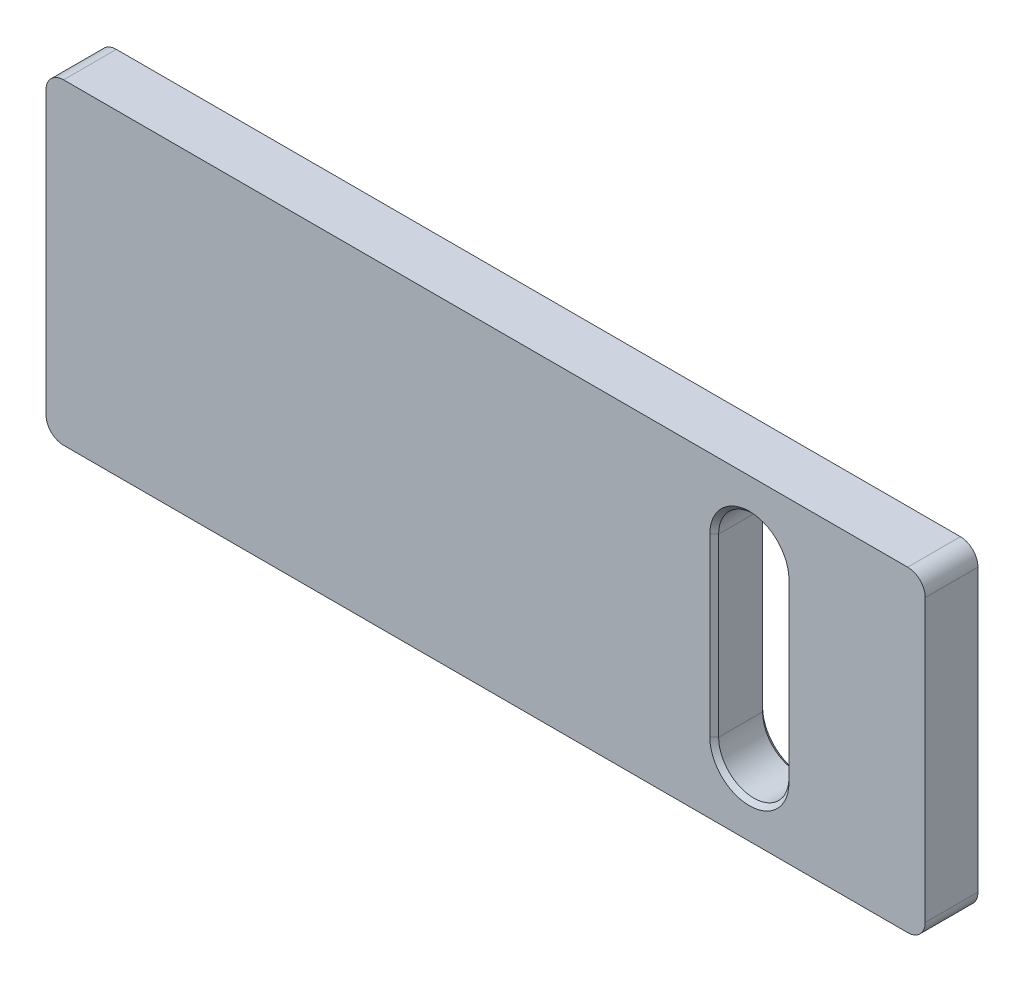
ISO-10303-21;
HEADER;
FILE_DESCRIPTION(('STEP AP214'),'2;1');
FILE_NAME('part.step','',(''),(''),'','','');
FILE_SCHEMA(('AUTOMOTIVE_DESIGN { 1 0 10303 214 1 1 1 1 }'));
ENDSEC;
DATA;
#1=APPLICATION_CONTEXT('core data for automotive mechanical design processes');
#2=APPLICATION_PROTOCOL_DEFINITION('international standard','automotive_design',2000,#1);
#3=PRODUCT_CONTEXT('',#1,'mechanical');
#4=PRODUCT('Part','Part','',(#3));
#5=PRODUCT_RELATED_PRODUCT_CATEGORY('part','',(#4));
#6=PRODUCT_DEFINITION_FORMATION('','',#4);
#7=PRODUCT_DEFINITION_CONTEXT('part definition',#1,'design');
#8=PRODUCT_DEFINITION('design','',#6,#7);
#9=PRODUCT_DEFINITION_SHAPE('','',#8);
#10=(LENGTH_UNIT() NAMED_UNIT(*) SI_UNIT(.MILLI.,.METRE.));
#11=(NAMED_UNIT(*) PLANE_ANGLE_UNIT() SI_UNIT($,.RADIAN.));
#12=(NAMED_UNIT(*) SI_UNIT($,.STERADIAN.) SOLID_ANGLE_UNIT());
#13=UNCERTAINTY_MEASURE_WITH_UNIT(LENGTH_MEASURE(1.E-05),#10,'distance_accuracy_value','');
#14=(GEOMETRIC_REPRESENTATION_CONTEXT(3) GLOBAL_UNCERTAINTY_ASSIGNED_CONTEXT((#13)) GLOBAL_UNIT_ASSIGNED_CONTEXT((#10,
#11,#12)) REPRESENTATION_CONTEXT('',''));
#15=CARTESIAN_POINT('',(0.,0.,0.));
#16=DIRECTION('',(0.,0.,1.));
#17=DIRECTION('',(1.,0.,0.));
#18=AXIS2_PLACEMENT_3D('',#15,#16,#17);
#19=CARTESIAN_POINT('',(25.,9.,3.));
#20=DIRECTION('',(-1.,0.,0.));
#21=DIRECTION('',(0.,0.,1.));
#22=AXIS2_PLACEMENT_3D('',#19,#20,#21);
#23=PLANE('',#22);
#24=DIRECTION('',(0.,1.,0.));
#25=VECTOR('',#24,1.);
#26=CARTESIAN_POINT('',(25.,9.,3.));
#27=LINE('',#26,#25);
#28=CARTESIAN_POINT('',(25.,-8.,3.));
#29=VERTEX_POINT('',#28);
#30=CARTESIAN_POINT('',(25.,8.,3.));
#31=VERTEX_POINT('',#30);
#32=EDGE_CURVE('E164',#29,#31,#27,.T.);
#33=ORIENTED_EDGE('',*,*,#32,.F.);
#34=DIRECTION('',(0.,0.,-1.));
#35=VECTOR('',#34,1.);
#36=CARTESIAN_POINT('',(25.,-8.,3.));
#37=LINE('',#36,#35);
#38=CARTESIAN_POINT('',(25.,-8.,0.));
#39=VERTEX_POINT('',#38);
#40=EDGE_CURVE('E149',#29,#39,#37,.T.);
#41=ORIENTED_EDGE('',*,*,#40,.T.);
#42=DIRECTION('',(0.,1.,0.));
#43=VECTOR('',#42,1.);
#44=CARTESIAN_POINT('',(25.,9.,0.));
#45=LINE('',#44,#43);
#46=CARTESIAN_POINT('',(25.,8.,0.));
#47=VERTEX_POINT('',#46);
#48=EDGE_CURVE('E161',#39,#47,#45,.T.);
#49=ORIENTED_EDGE('',*,*,#48,.T.);
#50=DIRECTION('',(0.,0.,-1.));
#51=VECTOR('',#50,1.);
#52=CARTESIAN_POINT('',(25.,8.,3.));
#53=LINE('',#52,#51);
#54=EDGE_CURVE('E166',#47,#31,#53,.F.);
#55=ORIENTED_EDGE('',*,*,#54,.T.);
#56=EDGE_LOOP('',(#33,#41,#49,#55));
#57=FACE_BOUND('',#56,.T.);
#58=ADVANCED_FACE('F32',(#57),#23,.F.);
#59=CARTESIAN_POINT('',(-25.,9.,3.));
#60=DIRECTION('',(0.,-1.,0.));
#61=DIRECTION('',(0.,0.,-1.));
#62=AXIS2_PLACEMENT_3D('',#59,#60,#61);
#63=PLANE('',#62);
#64=DIRECTION('',(-1.,0.,0.));
#65=VECTOR('',#64,1.);
#66=CARTESIAN_POINT('',(-25.,9.,3.));
#67=LINE('',#66,#65);
#68=CARTESIAN_POINT('',(24.,9.,3.));
#69=VERTEX_POINT('',#68);
#70=CARTESIAN_POINT('',(-24.,9.,3.));
#71=VERTEX_POINT('',#70);
#72=EDGE_CURVE('E288',#69,#71,#67,.T.);
#73=ORIENTED_EDGE('',*,*,#72,.F.);
#74=DIRECTION('',(0.,0.,-1.));
#75=VECTOR('',#74,1.);
#76=CARTESIAN_POINT('',(24.,9.,3.));
#77=LINE('',#76,#75);
#78=CARTESIAN_POINT('',(24.,9.,0.));
#79=VERTEX_POINT('',#78);
#80=EDGE_CURVE('E210',#69,#79,#77,.T.);
#81=ORIENTED_EDGE('',*,*,#80,.T.);
#82=DIRECTION('',(-1.,0.,0.));
#83=VECTOR('',#82,1.);
#84=CARTESIAN_POINT('',(-25.,9.,0.));
#85=LINE('',#84,#83);
#86=CARTESIAN_POINT('',(-24.,9.,0.));
#87=VERTEX_POINT('',#86);
#88=EDGE_CURVE('E171',#79,#87,#85,.T.);
#89=ORIENTED_EDGE('',*,*,#88,.T.);
#90=DIRECTION('',(0.,0.,-1.));
#91=VECTOR('',#90,1.);
#92=CARTESIAN_POINT('',(-24.,9.,3.));
#93=LINE('',#92,#91);
#94=EDGE_CURVE('E208',#87,#71,#93,.F.);
#95=ORIENTED_EDGE('',*,*,#94,.T.);
#96=EDGE_LOOP('',(#73,#81,#89,#95));
#97=FACE_BOUND('',#96,.T.);
#98=ADVANCED_FACE('F341',(#97),#63,.F.);
#99=CARTESIAN_POINT('',(-25.,9.,3.));
#100=DIRECTION('',(1.,0.,0.));
#101=DIRECTION('',(0.,0.,-1.));
#102=AXIS2_PLACEMENT_3D('',#99,#100,#101);
#103=PLANE('',#102);
#104=DIRECTION('',(0.,-1.,0.));
#105=VECTOR('',#104,1.);
#106=CARTESIAN_POINT('',(-25.,9.,0.));
#107=LINE('',#106,#105);
#108=CARTESIAN_POINT('',(-25.,8.,0.));
#109=VERTEX_POINT('',#108);
#110=CARTESIAN_POINT('',(-25.,-8.,0.));
#111=VERTEX_POINT('',#110);
#112=EDGE_CURVE('E175',#109,#111,#107,.T.);
#113=ORIENTED_EDGE('',*,*,#112,.T.);
#114=DIRECTION('',(0.,0.,-1.));
#115=VECTOR('',#114,1.);
#116=CARTESIAN_POINT('',(-25.,-8.,3.));
#117=LINE('',#116,#115);
#118=CARTESIAN_POINT('',(-25.,-8.,3.));
#119=VERTEX_POINT('',#118);
#120=EDGE_CURVE('E206',#111,#119,#117,.F.);
#121=ORIENTED_EDGE('',*,*,#120,.T.);
#122=DIRECTION('',(0.,-1.,0.));
#123=VECTOR('',#122,1.);
#124=CARTESIAN_POINT('',(-25.,9.,3.));
#125=LINE('',#124,#123);
#126=CARTESIAN_POINT('',(-25.,8.,3.));
#127=VERTEX_POINT('',#126);
#128=EDGE_CURVE('E287',#127,#119,#125,.T.);
#129=ORIENTED_EDGE('',*,*,#128,.F.);
#130=DIRECTION('',(0.,0.,-1.));
#131=VECTOR('',#130,1.);
#132=CARTESIAN_POINT('',(-25.,8.,3.));
#133=LINE('',#132,#131);
#134=EDGE_CURVE('E203',#127,#109,#133,.T.);
#135=ORIENTED_EDGE('',*,*,#134,.T.);
#136=EDGE_LOOP('',(#113,#121,#129,#135));
#137=FACE_BOUND('',#136,.T.);
#138=ADVANCED_FACE('F346',(#137),#103,.F.);
#139=CARTESIAN_POINT('',(-25.,-9.,3.));
#140=DIRECTION('',(0.,1.,0.));
#141=DIRECTION('',(0.,0.,1.));
#142=AXIS2_PLACEMENT_3D('',#139,#140,#141);
#143=PLANE('',#142);
#144=DIRECTION('',(1.,0.,0.));
#145=VECTOR('',#144,1.);
#146=CARTESIAN_POINT('',(-25.,-9.,0.));
#147=LINE('',#146,#145);
#148=CARTESIAN_POINT('',(-24.,-9.,0.));
#149=VERTEX_POINT('',#148);
#150=CARTESIAN_POINT('',(24.,-9.,0.));
#151=VERTEX_POINT('',#150);
#152=EDGE_CURVE('E186',#149,#151,#147,.T.);
#153=ORIENTED_EDGE('',*,*,#152,.T.);
#154=DIRECTION('',(0.,0.,-1.));
#155=VECTOR('',#154,1.);
#156=CARTESIAN_POINT('',(24.,-9.,3.));
#157=LINE('',#156,#155);
#158=CARTESIAN_POINT('',(24.,-9.,3.));
#159=VERTEX_POINT('',#158);
#160=EDGE_CURVE('E150',#151,#159,#157,.F.);
#161=ORIENTED_EDGE('',*,*,#160,.T.);
#162=DIRECTION('',(1.,0.,0.));
#163=VECTOR('',#162,1.);
#164=CARTESIAN_POINT('',(-25.,-9.,3.));
#165=LINE('',#164,#163);
#166=CARTESIAN_POINT('',(-24.,-9.,3.));
#167=VERTEX_POINT('',#166);
#168=EDGE_CURVE('E181',#167,#159,#165,.T.);
#169=ORIENTED_EDGE('',*,*,#168,.F.);
#170=DIRECTION('',(0.,0.,-1.));
#171=VECTOR('',#170,1.);
#172=CARTESIAN_POINT('',(-24.,-9.,3.));
#173=LINE('',#172,#171);
#174=EDGE_CURVE('E155',#167,#149,#173,.T.);
#175=ORIENTED_EDGE('',*,*,#174,.T.);
#176=EDGE_LOOP('',(#153,#161,#169,#175));
#177=FACE_BOUND('',#176,.T.);
#178=ADVANCED_FACE('F279',(#177),#143,.F.);
#179=CARTESIAN_POINT('',(0.,0.,3.));
#180=DIRECTION('',(0.,0.,1.));
#181=DIRECTION('',(1.,0.,0.));
#182=AXIS2_PLACEMENT_3D('',#179,#180,#181);
#183=PLANE('',#182);
#184=DIRECTION('',(0.,1.,0.));
#185=VECTOR('',#184,1.);
#186=CARTESIAN_POINT('',(12.75,5.,3.));
#187=LINE('',#186,#185);
#188=CARTESIAN_POINT('',(12.75,-5.,3.));
#189=VERTEX_POINT('',#188);
#190=CARTESIAN_POINT('',(12.75,5.,3.));
#191=VERTEX_POINT('',#190);
#192=EDGE_CURVE('E41',#189,#191,#187,.T.);
#193=ORIENTED_EDGE('',*,*,#192,.T.);
#194=CARTESIAN_POINT('',(15.,5.,3.));
#195=DIRECTION('',(0.,0.,1.));
#196=DIRECTION('',(1.,0.,0.));
#197=AXIS2_PLACEMENT_3D('',#194,#195,#196);
#198=CIRCLE('',#197,2.25);
#199=CARTESIAN_POINT('',(17.25,5.,3.));
#200=VERTEX_POINT('',#199);
#201=EDGE_CURVE('E11',#191,#200,#198,.F.);
#202=ORIENTED_EDGE('',*,*,#201,.T.);
#203=DIRECTION('',(0.,-1.,0.));
#204=VECTOR('',#203,1.);
#205=CARTESIAN_POINT('',(17.25,-5.,3.));
#206=LINE('',#205,#204);
#207=CARTESIAN_POINT('',(17.25,-5.,3.));
#208=VERTEX_POINT('',#207);
#209=EDGE_CURVE('E240',#200,#208,#206,.T.);
#210=ORIENTED_EDGE('',*,*,#209,.T.);
#211=CARTESIAN_POINT('',(15.,-5.,3.));
#212=DIRECTION('',(0.,0.,1.));
#213=DIRECTION('',(1.,0.,0.));
#214=AXIS2_PLACEMENT_3D('',#211,#212,#213);
#215=CIRCLE('',#214,2.24999999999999);
#216=EDGE_CURVE('E52',#208,#189,#215,.F.);
#217=ORIENTED_EDGE('',*,*,#216,.T.);
#218=EDGE_LOOP('',(#193,#202,#210,#217));
#219=FACE_BOUND('',#218,.T.);
#220=ORIENTED_EDGE('',*,*,#168,.T.);
#221=CARTESIAN_POINT('',(24.,-8.,3.));
#222=DIRECTION('',(0.,0.,1.));
#223=DIRECTION('',(1.,0.,0.));
#224=AXIS2_PLACEMENT_3D('',#221,#222,#223);
#225=CIRCLE('',#224,1.);
#226=EDGE_CURVE('E201',#159,#29,#225,.T.);
#227=ORIENTED_EDGE('',*,*,#226,.T.);
#228=ORIENTED_EDGE('',*,*,#32,.T.);
#229=CARTESIAN_POINT('',(24.,8.,3.));
#230=DIRECTION('',(0.,0.,1.));
#231=DIRECTION('',(1.,0.,0.));
#232=AXIS2_PLACEMENT_3D('',#229,#230,#231);
#233=CIRCLE('',#232,1.);
#234=EDGE_CURVE('E197',#31,#69,#233,.T.);
#235=ORIENTED_EDGE('',*,*,#234,.T.);
#236=ORIENTED_EDGE('',*,*,#72,.T.);
#237=CARTESIAN_POINT('',(-24.,8.,3.));
#238=DIRECTION('',(0.,0.,1.));
#239=DIRECTION('',(1.,0.,0.));
#240=AXIS2_PLACEMENT_3D('',#237,#238,#239);
#241=CIRCLE('',#240,1.);
#242=EDGE_CURVE('E195',#71,#127,#241,.T.);
#243=ORIENTED_EDGE('',*,*,#242,.T.);
#244=ORIENTED_EDGE('',*,*,#128,.T.);
#245=CARTESIAN_POINT('',(-24.,-8.,3.));
#246=DIRECTION('',(0.,0.,1.));
#247=DIRECTION('',(1.,0.,0.));
#248=AXIS2_PLACEMENT_3D('',#245,#246,#247);
#249=CIRCLE('',#248,1.);
#250=EDGE_CURVE('E199',#119,#167,#249,.T.);
#251=ORIENTED_EDGE('',*,*,#250,.T.);
#252=EDGE_LOOP('',(#220,#227,#228,#235,#236,#243,#244,#251));
#253=FACE_BOUND('',#252,.T.);
#254=ADVANCED_FACE('F276',(#219,#253),#183,.T.);
#255=CARTESIAN_POINT('',(0.,0.,0.));
#256=DIRECTION('',(0.,0.,1.));
#257=DIRECTION('',(1.,0.,0.));
#258=AXIS2_PLACEMENT_3D('',#255,#256,#257);
#259=PLANE('',#258);
#260=CARTESIAN_POINT('',(15.,5.,0.));
#261=DIRECTION('',(0.,0.,1.));
#262=DIRECTION('',(1.,0.,0.));
#263=AXIS2_PLACEMENT_3D('',#260,#261,#262);
#264=CIRCLE('',#263,2.25000000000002);
#265=CARTESIAN_POINT('',(17.25,5.,0.));
#266=VERTEX_POINT('',#265);
#267=CARTESIAN_POINT('',(12.75,5.,0.));
#268=VERTEX_POINT('',#267);
#269=EDGE_CURVE('E218',#266,#268,#264,.T.);
#270=ORIENTED_EDGE('',*,*,#269,.T.);
#271=DIRECTION('',(0.,-1.,0.));
#272=VECTOR('',#271,1.);
#273=CARTESIAN_POINT('',(12.75,0.,0.));
#274=LINE('',#273,#272);
#275=CARTESIAN_POINT('',(12.75,-5.,0.));
#276=VERTEX_POINT('',#275);
#277=EDGE_CURVE('E224',#268,#276,#274,.T.);
#278=ORIENTED_EDGE('',*,*,#277,.T.);
#279=CARTESIAN_POINT('',(15.,-5.,0.));
#280=DIRECTION('',(0.,0.,1.));
#281=DIRECTION('',(1.,0.,0.));
#282=AXIS2_PLACEMENT_3D('',#279,#280,#281);
#283=CIRCLE('',#282,2.25000000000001);
#284=CARTESIAN_POINT('',(17.25,-5.,0.));
#285=VERTEX_POINT('',#284);
#286=EDGE_CURVE('E222',#276,#285,#283,.T.);
#287=ORIENTED_EDGE('',*,*,#286,.T.);
#288=DIRECTION('',(0.,1.,0.));
#289=VECTOR('',#288,1.);
#290=CARTESIAN_POINT('',(17.25,0.,0.));
#291=LINE('',#290,#289);
#292=EDGE_CURVE('E220',#285,#266,#291,.T.);
#293=ORIENTED_EDGE('',*,*,#292,.T.);
#294=EDGE_LOOP('',(#270,#278,#287,#293));
#295=FACE_BOUND('',#294,.T.);
#296=ORIENTED_EDGE('',*,*,#48,.F.);
#297=CARTESIAN_POINT('',(24.,-8.,0.));
#298=DIRECTION('',(0.,0.,1.));
#299=DIRECTION('',(1.,0.,0.));
#300=AXIS2_PLACEMENT_3D('',#297,#298,#299);
#301=CIRCLE('',#300,1.);
#302=EDGE_CURVE('E145',#39,#151,#301,.F.);
#303=ORIENTED_EDGE('',*,*,#302,.T.);
#304=ORIENTED_EDGE('',*,*,#152,.F.);
#305=CARTESIAN_POINT('',(-24.,-8.,0.));
#306=DIRECTION('',(0.,0.,1.));
#307=DIRECTION('',(1.,0.,0.));
#308=AXIS2_PLACEMENT_3D('',#305,#306,#307);
#309=CIRCLE('',#308,1.);
#310=EDGE_CURVE('E156',#149,#111,#309,.F.);
#311=ORIENTED_EDGE('',*,*,#310,.T.);
#312=ORIENTED_EDGE('',*,*,#112,.F.);
#313=CARTESIAN_POINT('',(-24.,8.,0.));
#314=DIRECTION('',(0.,0.,1.));
#315=DIRECTION('',(1.,0.,0.));
#316=AXIS2_PLACEMENT_3D('',#313,#314,#315);
#317=CIRCLE('',#316,1.);
#318=EDGE_CURVE('E165',#109,#87,#317,.F.);
#319=ORIENTED_EDGE('',*,*,#318,.T.);
#320=ORIENTED_EDGE('',*,*,#88,.F.);
#321=CARTESIAN_POINT('',(24.,8.,0.));
#322=DIRECTION('',(0.,0.,1.));
#323=DIRECTION('',(1.,0.,0.));
#324=AXIS2_PLACEMENT_3D('',#321,#322,#323);
#325=CIRCLE('',#324,1.);
#326=EDGE_CURVE('E170',#79,#47,#325,.F.);
#327=ORIENTED_EDGE('',*,*,#326,.T.);
#328=EDGE_LOOP('',(#296,#303,#304,#311,#312,#319,#320,#327));
#329=FACE_BOUND('',#328,.T.);
#330=ADVANCED_FACE('F168',(#295,#329),#259,.F.);
#331=CARTESIAN_POINT('',(15.,5.,-0.00100000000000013));
#332=DIRECTION('',(0.,0.,1.));
#333=DIRECTION('',(1.,0.,0.));
#334=AXIS2_PLACEMENT_3D('',#331,#332,#333);
#335=CYLINDRICAL_SURFACE('',#334,2.);
#336=DIRECTION('',(0.,0.,1.));
#337=VECTOR('',#336,1.);
#338=CARTESIAN_POINT('',(13.,5.,-0.00100000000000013));
#339=LINE('',#338,#337);
#340=CARTESIAN_POINT('',(13.,5.,0.250000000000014));
#341=VERTEX_POINT('',#340);
#342=CARTESIAN_POINT('',(13.,5.,2.75000000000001));
#343=VERTEX_POINT('',#342);
#344=EDGE_CURVE('E254',#341,#343,#339,.T.);
#345=ORIENTED_EDGE('',*,*,#344,.F.);
#346=CARTESIAN_POINT('',(15.,5.,0.250000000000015));
#347=DIRECTION('',(0.,0.,1.));
#348=DIRECTION('',(1.,0.,0.));
#349=AXIS2_PLACEMENT_3D('',#346,#347,#348);
#350=CIRCLE('',#349,2.);
#351=CARTESIAN_POINT('',(17.,5.,0.250000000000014));
#352=VERTEX_POINT('',#351);
#353=EDGE_CURVE('E238',#341,#352,#350,.F.);
#354=ORIENTED_EDGE('',*,*,#353,.T.);
#355=DIRECTION('',(0.,0.,1.));
#356=VECTOR('',#355,1.);
#357=CARTESIAN_POINT('',(17.,5.,-0.00100000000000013));
#358=LINE('',#357,#356);
#359=CARTESIAN_POINT('',(17.,5.,2.75000000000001));
#360=VERTEX_POINT('',#359);
#361=EDGE_CURVE('E172',#352,#360,#358,.T.);
#362=ORIENTED_EDGE('',*,*,#361,.T.);
#363=CARTESIAN_POINT('',(15.,5.,2.75000000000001));
#364=DIRECTION('',(0.,0.,1.));
#365=DIRECTION('',(1.,0.,0.));
#366=AXIS2_PLACEMENT_3D('',#363,#364,#365);
#367=CIRCLE('',#366,2.);
#368=EDGE_CURVE('E235',#360,#343,#367,.T.);
#369=ORIENTED_EDGE('',*,*,#368,.T.);
#370=EDGE_LOOP('',(#345,#354,#362,#369));
#371=FACE_BOUND('',#370,.T.);
#372=ADVANCED_FACE('F328',(#371),#335,.F.);
#373=CARTESIAN_POINT('',(17.,5.,-0.00100000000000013));
#374=DIRECTION('',(1.,0.,0.));
#375=DIRECTION('',(0.,0.,-1.));
#376=AXIS2_PLACEMENT_3D('',#373,#374,#375);
#377=PLANE('',#376);
#378=ORIENTED_EDGE('',*,*,#361,.F.);
#379=DIRECTION('',(0.,-1.,0.));
#380=VECTOR('',#379,1.);
#381=CARTESIAN_POINT('',(17.,5.,0.250000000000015));
#382=LINE('',#381,#380);
#383=CARTESIAN_POINT('',(17.,-5.,0.250000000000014));
#384=VERTEX_POINT('',#383);
#385=EDGE_CURVE('E233',#352,#384,#382,.T.);
#386=ORIENTED_EDGE('',*,*,#385,.T.);
#387=DIRECTION('',(0.,0.,1.));
#388=VECTOR('',#387,1.);
#389=CARTESIAN_POINT('',(17.,-5.,-0.00100000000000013));
#390=LINE('',#389,#388);
#391=CARTESIAN_POINT('',(17.,-5.,2.75000000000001));
#392=VERTEX_POINT('',#391);
#393=EDGE_CURVE('E178',#384,#392,#390,.T.);
#394=ORIENTED_EDGE('',*,*,#393,.T.);
#395=DIRECTION('',(0.,1.,0.));
#396=VECTOR('',#395,1.);
#397=CARTESIAN_POINT('',(17.,5.,2.75000000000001));
#398=LINE('',#397,#396);
#399=EDGE_CURVE('E231',#392,#360,#398,.T.);
#400=ORIENTED_EDGE('',*,*,#399,.T.);
#401=EDGE_LOOP('',(#378,#386,#394,#400));
#402=FACE_BOUND('',#401,.T.);
#403=ADVANCED_FACE('F303',(#402),#377,.F.);
#404=CARTESIAN_POINT('',(15.,-5.,-0.00100000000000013));
#405=DIRECTION('',(0.,0.,1.));
#406=DIRECTION('',(1.,0.,0.));
#407=AXIS2_PLACEMENT_3D('',#404,#405,#406);
#408=CYLINDRICAL_SURFACE('',#407,2.);
#409=ORIENTED_EDGE('',*,*,#393,.F.);
#410=CARTESIAN_POINT('',(15.,-5.,0.250000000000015));
#411=DIRECTION('',(0.,0.,1.));
#412=DIRECTION('',(1.,0.,0.));
#413=AXIS2_PLACEMENT_3D('',#410,#411,#412);
#414=CIRCLE('',#413,2.);
#415=CARTESIAN_POINT('',(13.,-5.,0.250000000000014));
#416=VERTEX_POINT('',#415);
#417=EDGE_CURVE('E229',#384,#416,#414,.F.);
#418=ORIENTED_EDGE('',*,*,#417,.T.);
#419=DIRECTION('',(0.,0.,1.));
#420=VECTOR('',#419,1.);
#421=CARTESIAN_POINT('',(13.,-5.,-0.00100000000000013));
#422=LINE('',#421,#420);
#423=CARTESIAN_POINT('',(13.,-5.,2.75000000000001));
#424=VERTEX_POINT('',#423);
#425=EDGE_CURVE('E296',#416,#424,#422,.T.);
#426=ORIENTED_EDGE('',*,*,#425,.T.);
#427=CARTESIAN_POINT('',(15.,-5.,2.75000000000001));
#428=DIRECTION('',(0.,0.,1.));
#429=DIRECTION('',(1.,0.,0.));
#430=AXIS2_PLACEMENT_3D('',#427,#428,#429);
#431=CIRCLE('',#430,2.);
#432=EDGE_CURVE('E227',#424,#392,#431,.T.);
#433=ORIENTED_EDGE('',*,*,#432,.T.);
#434=EDGE_LOOP('',(#409,#418,#426,#433));
#435=FACE_BOUND('',#434,.T.);
#436=ADVANCED_FACE('F307',(#435),#408,.F.);
#437=CARTESIAN_POINT('',(13.,5.,-0.00100000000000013));
#438=DIRECTION('',(-1.,0.,0.));
#439=DIRECTION('',(0.,0.,1.));
#440=AXIS2_PLACEMENT_3D('',#437,#438,#439);
#441=PLANE('',#440);
#442=ORIENTED_EDGE('',*,*,#425,.F.);
#443=DIRECTION('',(0.,1.,0.));
#444=VECTOR('',#443,1.);
#445=CARTESIAN_POINT('',(13.,5.,0.250000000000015));
#446=LINE('',#445,#444);
#447=EDGE_CURVE('E215',#416,#341,#446,.T.);
#448=ORIENTED_EDGE('',*,*,#447,.T.);
#449=ORIENTED_EDGE('',*,*,#344,.T.);
#450=DIRECTION('',(0.,-1.,0.));
#451=VECTOR('',#450,1.);
#452=CARTESIAN_POINT('',(13.,-5.,2.75000000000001));
#453=LINE('',#452,#451);
#454=EDGE_CURVE('E213',#343,#424,#453,.T.);
#455=ORIENTED_EDGE('',*,*,#454,.T.);
#456=EDGE_LOOP('',(#442,#448,#449,#455));
#457=FACE_BOUND('',#456,.T.);
#458=ADVANCED_FACE('F326',(#457),#441,.F.);
#459=CARTESIAN_POINT('',(24.,-8.,3.));
#460=DIRECTION('',(0.,0.,-1.));
#461=DIRECTION('',(-1.,0.,0.));
#462=AXIS2_PLACEMENT_3D('',#459,#460,#461);
#463=CYLINDRICAL_SURFACE('',#462,1.);
#464=ORIENTED_EDGE('',*,*,#226,.F.);
#465=ORIENTED_EDGE('',*,*,#160,.F.);
#466=ORIENTED_EDGE('',*,*,#302,.F.);
#467=ORIENTED_EDGE('',*,*,#40,.F.);
#468=EDGE_LOOP('',(#464,#465,#466,#467));
#469=FACE_BOUND('',#468,.T.);
#470=ADVANCED_FACE('F148',(#469),#463,.T.);
#471=CARTESIAN_POINT('',(-24.,-8.,3.));
#472=DIRECTION('',(0.,0.,-1.));
#473=DIRECTION('',(-1.,0.,0.));
#474=AXIS2_PLACEMENT_3D('',#471,#472,#473);
#475=CYLINDRICAL_SURFACE('',#474,1.);
#476=ORIENTED_EDGE('',*,*,#250,.F.);
#477=ORIENTED_EDGE('',*,*,#120,.F.);
#478=ORIENTED_EDGE('',*,*,#310,.F.);
#479=ORIENTED_EDGE('',*,*,#174,.F.);
#480=EDGE_LOOP('',(#476,#477,#478,#479));
#481=FACE_BOUND('',#480,.T.);
#482=ADVANCED_FACE('F353',(#481),#475,.T.);
#483=CARTESIAN_POINT('',(24.,8.,3.));
#484=DIRECTION('',(0.,0.,-1.));
#485=DIRECTION('',(-1.,0.,0.));
#486=AXIS2_PLACEMENT_3D('',#483,#484,#485);
#487=CYLINDRICAL_SURFACE('',#486,1.);
#488=ORIENTED_EDGE('',*,*,#234,.F.);
#489=ORIENTED_EDGE('',*,*,#54,.F.);
#490=ORIENTED_EDGE('',*,*,#326,.F.);
#491=ORIENTED_EDGE('',*,*,#80,.F.);
#492=EDGE_LOOP('',(#488,#489,#490,#491));
#493=FACE_BOUND('',#492,.T.);
#494=ADVANCED_FACE('F356',(#493),#487,.T.);
#495=CARTESIAN_POINT('',(-24.,8.,3.));
#496=DIRECTION('',(0.,0.,-1.));
#497=DIRECTION('',(-1.,0.,0.));
#498=AXIS2_PLACEMENT_3D('',#495,#496,#497);
#499=CYLINDRICAL_SURFACE('',#498,1.);
#500=ORIENTED_EDGE('',*,*,#242,.F.);
#501=ORIENTED_EDGE('',*,*,#94,.F.);
#502=ORIENTED_EDGE('',*,*,#318,.F.);
#503=ORIENTED_EDGE('',*,*,#134,.F.);
#504=EDGE_LOOP('',(#500,#501,#502,#503));
#505=FACE_BOUND('',#504,.T.);
#506=ADVANCED_FACE('F360',(#505),#499,.T.);
#507=CARTESIAN_POINT('',(17.,5.,0.250000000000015));
#508=DIRECTION('',(0.707106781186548,0.,0.707106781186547));
#509=DIRECTION('',(0.,-1.,0.));
#510=AXIS2_PLACEMENT_3D('',#507,#508,#509);
#511=PLANE('',#510);
#512=DIRECTION('',(-0.707106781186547,0.,0.707106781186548));
#513=VECTOR('',#512,1.);
#514=CARTESIAN_POINT('',(17.25,5.,0.));
#515=LINE('',#514,#513);
#516=EDGE_CURVE('E248',#266,#352,#515,.T.);
#517=ORIENTED_EDGE('',*,*,#516,.F.);
#518=ORIENTED_EDGE('',*,*,#292,.F.);
#519=DIRECTION('',(0.707106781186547,0.,-0.707106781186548));
#520=VECTOR('',#519,1.);
#521=CARTESIAN_POINT('',(17.,-5.,0.250000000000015));
#522=LINE('',#521,#520);
#523=EDGE_CURVE('E251',#384,#285,#522,.T.);
#524=ORIENTED_EDGE('',*,*,#523,.F.);
#525=ORIENTED_EDGE('',*,*,#385,.F.);
#526=EDGE_LOOP('',(#517,#518,#524,#525));
#527=FACE_BOUND('',#526,.T.);
#528=ADVANCED_FACE('F313',(#527),#511,.F.);
#529=CARTESIAN_POINT('',(15.,-5.,0.250000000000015));
#530=DIRECTION('',(0.,0.,-1.));
#531=DIRECTION('',(-1.,0.,0.));
#532=AXIS2_PLACEMENT_3D('',#529,#530,#531);
#533=CONICAL_SURFACE('',#532,2.,0.785398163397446);
#534=ORIENTED_EDGE('',*,*,#523,.T.);
#535=ORIENTED_EDGE('',*,*,#286,.F.);
#536=DIRECTION('',(-0.707106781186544,0.,-0.707106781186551));
#537=VECTOR('',#536,1.);
#538=CARTESIAN_POINT('',(13.,-5.,0.250000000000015));
#539=LINE('',#538,#537);
#540=EDGE_CURVE('E246',#416,#276,#539,.T.);
#541=ORIENTED_EDGE('',*,*,#540,.F.);
#542=ORIENTED_EDGE('',*,*,#417,.F.);
#543=EDGE_LOOP('',(#534,#535,#541,#542));
#544=FACE_BOUND('',#543,.T.);
#545=ADVANCED_FACE('F317',(#544),#533,.F.);
#546=CARTESIAN_POINT('',(15.,5.,0.250000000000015));
#547=DIRECTION('',(0.,0.,-1.));
#548=DIRECTION('',(-1.,0.,0.));
#549=AXIS2_PLACEMENT_3D('',#546,#547,#548);
#550=CONICAL_SURFACE('',#549,2.,0.785398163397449);
#551=ORIENTED_EDGE('',*,*,#516,.T.);
#552=ORIENTED_EDGE('',*,*,#353,.F.);
#553=DIRECTION('',(0.707106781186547,0.,0.707106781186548));
#554=VECTOR('',#553,1.);
#555=CARTESIAN_POINT('',(12.75,5.,0.));
#556=LINE('',#555,#554);
#557=EDGE_CURVE('E244',#268,#341,#556,.T.);
#558=ORIENTED_EDGE('',*,*,#557,.F.);
#559=ORIENTED_EDGE('',*,*,#269,.F.);
#560=EDGE_LOOP('',(#551,#552,#558,#559));
#561=FACE_BOUND('',#560,.T.);
#562=ADVANCED_FACE('F330',(#561),#550,.F.);
#563=CARTESIAN_POINT('',(13.,5.,0.250000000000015));
#564=DIRECTION('',(-0.707106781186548,0.,0.707106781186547));
#565=DIRECTION('',(0.,1.,0.));
#566=AXIS2_PLACEMENT_3D('',#563,#564,#565);
#567=PLANE('',#566);
#568=ORIENTED_EDGE('',*,*,#540,.T.);
#569=ORIENTED_EDGE('',*,*,#277,.F.);
#570=ORIENTED_EDGE('',*,*,#557,.T.);
#571=ORIENTED_EDGE('',*,*,#447,.F.);
#572=EDGE_LOOP('',(#568,#569,#570,#571));
#573=FACE_BOUND('',#572,.T.);
#574=ADVANCED_FACE('F321',(#573),#567,.F.);
#575=CARTESIAN_POINT('',(15.,-5.,2.75000000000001));
#576=DIRECTION('',(0.,0.,1.));
#577=DIRECTION('',(1.,0.,0.));
#578=AXIS2_PLACEMENT_3D('',#575,#576,#577);
#579=CONICAL_SURFACE('',#578,2.,0.785398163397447);
#580=DIRECTION('',(0.707106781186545,0.,-0.70710678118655));
#581=VECTOR('',#580,1.);
#582=CARTESIAN_POINT('',(12.75,-5.,3.));
#583=LINE('',#582,#581);
#584=EDGE_CURVE('E258',#189,#424,#583,.T.);
#585=ORIENTED_EDGE('',*,*,#584,.F.);
#586=ORIENTED_EDGE('',*,*,#216,.F.);
#587=DIRECTION('',(0.707106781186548,0.,0.707106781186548));
#588=VECTOR('',#587,1.);
#589=CARTESIAN_POINT('',(17.,-5.,2.75000000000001));
#590=LINE('',#589,#588);
#591=EDGE_CURVE('E36',#392,#208,#590,.T.);
#592=ORIENTED_EDGE('',*,*,#591,.F.);
#593=ORIENTED_EDGE('',*,*,#432,.F.);
#594=EDGE_LOOP('',(#585,#586,#592,#593));
#595=FACE_BOUND('',#594,.T.);
#596=ADVANCED_FACE('F34',(#595),#579,.F.);
#597=CARTESIAN_POINT('',(17.,5.,2.75000000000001));
#598=DIRECTION('',(-0.707106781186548,0.,0.707106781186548));
#599=DIRECTION('',(0.,-1.,0.));
#600=AXIS2_PLACEMENT_3D('',#597,#598,#599);
#601=PLANE('',#600);
#602=ORIENTED_EDGE('',*,*,#591,.T.);
#603=ORIENTED_EDGE('',*,*,#209,.F.);
#604=DIRECTION('',(0.707106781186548,0.,0.707106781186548));
#605=VECTOR('',#604,1.);
#606=CARTESIAN_POINT('',(17.,5.,2.75000000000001));
#607=LINE('',#606,#605);
#608=EDGE_CURVE('E257',#360,#200,#607,.T.);
#609=ORIENTED_EDGE('',*,*,#608,.F.);
#610=ORIENTED_EDGE('',*,*,#399,.F.);
#611=EDGE_LOOP('',(#602,#603,#609,#610));
#612=FACE_BOUND('',#611,.T.);
#613=ADVANCED_FACE('F267',(#612),#601,.T.);
#614=CARTESIAN_POINT('',(13.,5.,2.75000000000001));
#615=DIRECTION('',(0.707106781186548,0.,0.707106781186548));
#616=DIRECTION('',(0.,1.,0.));
#617=AXIS2_PLACEMENT_3D('',#614,#615,#616);
#618=PLANE('',#617);
#619=ORIENTED_EDGE('',*,*,#584,.T.);
#620=ORIENTED_EDGE('',*,*,#454,.F.);
#621=DIRECTION('',(0.707106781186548,0.,-0.707106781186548));
#622=VECTOR('',#621,1.);
#623=CARTESIAN_POINT('',(12.75,5.,3.));
#624=LINE('',#623,#622);
#625=EDGE_CURVE('E255',#191,#343,#624,.T.);
#626=ORIENTED_EDGE('',*,*,#625,.F.);
#627=ORIENTED_EDGE('',*,*,#192,.F.);
#628=EDGE_LOOP('',(#619,#620,#626,#627));
#629=FACE_BOUND('',#628,.T.);
#630=ADVANCED_FACE('F272',(#629),#618,.T.);
#631=CARTESIAN_POINT('',(15.,5.,2.75000000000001));
#632=DIRECTION('',(0.,0.,1.));
#633=DIRECTION('',(1.,0.,0.));
#634=AXIS2_PLACEMENT_3D('',#631,#632,#633);
#635=CONICAL_SURFACE('',#634,2.,0.78539816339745);
#636=ORIENTED_EDGE('',*,*,#608,.T.);
#637=ORIENTED_EDGE('',*,*,#201,.F.);
#638=ORIENTED_EDGE('',*,*,#625,.T.);
#639=ORIENTED_EDGE('',*,*,#368,.F.);
#640=EDGE_LOOP('',(#636,#637,#638,#639));
#641=FACE_BOUND('',#640,.T.);
#642=ADVANCED_FACE('F275',(#641),#635,.F.);
#643=CLOSED_SHELL('',(#58,#98,#138,#178,#254,#330,#372,#403,#436,#458,#470,#482,#494,#506,#528,
#545,#562,#574,#596,#613,#630,#642));
#644=MANIFOLD_SOLID_BREP('B2',#643);
#645=ADVANCED_BREP_SHAPE_REPRESENTATION('',(#18,#644),#14);
#646=SHAPE_DEFINITION_REPRESENTATION(#9,#645);
ENDSEC;
END-ISO-10303-21;
